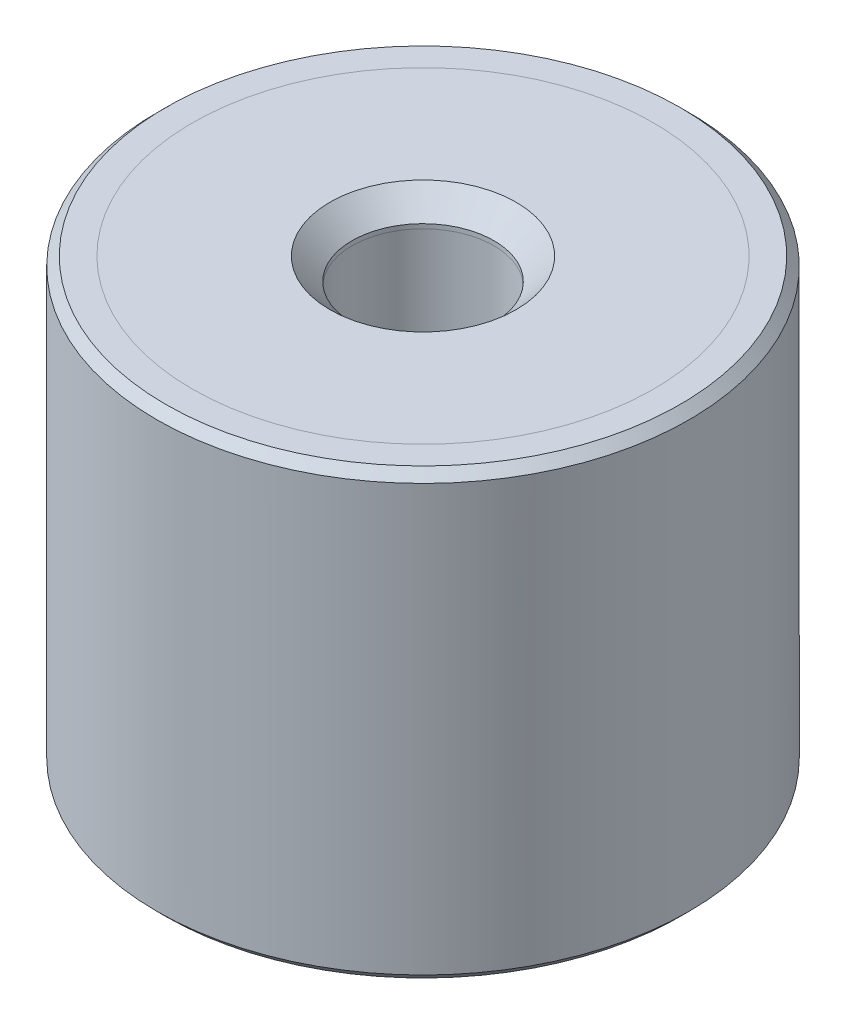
ISO-10303-21;
HEADER;
FILE_DESCRIPTION(('STEP AP214'),'2;1');
FILE_NAME('part.step','',(''),(''),'','','');
FILE_SCHEMA(('AUTOMOTIVE_DESIGN { 1 0 10303 214 1 1 1 1 }'));
ENDSEC;
DATA;
#1=APPLICATION_CONTEXT('core data for automotive mechanical design processes');
#2=APPLICATION_PROTOCOL_DEFINITION('international standard','automotive_design',2000,#1);
#3=PRODUCT_CONTEXT('',#1,'mechanical');
#4=PRODUCT('Part','Part','',(#3));
#5=PRODUCT_RELATED_PRODUCT_CATEGORY('part','',(#4));
#6=PRODUCT_DEFINITION_FORMATION('','',#4);
#7=PRODUCT_DEFINITION_CONTEXT('part definition',#1,'design');
#8=PRODUCT_DEFINITION('design','',#6,#7);
#9=PRODUCT_DEFINITION_SHAPE('','',#8);
#10=(LENGTH_UNIT() NAMED_UNIT(*) SI_UNIT(.MILLI.,.METRE.));
#11=(NAMED_UNIT(*) PLANE_ANGLE_UNIT() SI_UNIT($,.RADIAN.));
#12=(NAMED_UNIT(*) SI_UNIT($,.STERADIAN.) SOLID_ANGLE_UNIT());
#13=UNCERTAINTY_MEASURE_WITH_UNIT(LENGTH_MEASURE(1.E-05),#10,'distance_accuracy_value','');
#14=(GEOMETRIC_REPRESENTATION_CONTEXT(3) GLOBAL_UNCERTAINTY_ASSIGNED_CONTEXT((#13)) GLOBAL_UNIT_ASSIGNED_CONTEXT((#10,
#11,#12)) REPRESENTATION_CONTEXT('',''));
#15=CARTESIAN_POINT('',(0.,0.,0.));
#16=DIRECTION('',(0.,0.,1.));
#17=DIRECTION('',(1.,0.,0.));
#18=AXIS2_PLACEMENT_3D('',#15,#16,#17);
#19=CARTESIAN_POINT('',(0.,46.0340428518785,0.));
#20=DIRECTION('',(0.,1.,0.));
#21=DIRECTION('',(0.,0.,1.));
#22=AXIS2_PLACEMENT_3D('',#19,#20,#21);
#23=CYLINDRICAL_SURFACE('',#22,4.);
#24=CARTESIAN_POINT('',(0.,-22.25,0.));
#25=DIRECTION('',(0.,-1.,0.));
#26=DIRECTION('',(0.,0.,-1.));
#27=AXIS2_PLACEMENT_3D('',#24,#25,#26);
#28=CIRCLE('',#27,4.);
#29=CARTESIAN_POINT('',(0.,-22.25,-4.));
#30=VERTEX_POINT('',#29);
#31=EDGE_CURVE('P0_E10',#30,#30,#28,.T.);
#32=ORIENTED_EDGE('',*,*,#31,.T.);
#33=EDGE_LOOP('',(#32));
#34=FACE_BOUND('',#33,.T.);
#35=CARTESIAN_POINT('',(0.,-22.,0.));
#36=DIRECTION('',(0.,1.,0.));
#37=DIRECTION('',(0.,0.,1.));
#38=AXIS2_PLACEMENT_3D('',#35,#36,#37);
#39=CIRCLE('',#38,4.);
#40=CARTESIAN_POINT('',(0.,-22.,4.));
#41=VERTEX_POINT('',#40);
#42=EDGE_CURVE('P0_E25',#41,#41,#39,.T.);
#43=ORIENTED_EDGE('',*,*,#42,.T.);
#44=EDGE_LOOP('',(#43));
#45=FACE_BOUND('',#44,.T.);
#46=ADVANCED_FACE('P0_F14',(#34,#45),#23,.F.);
#47=CARTESIAN_POINT('',(0.,-22.,4.));
#48=DIRECTION('',(0.,1.,0.));
#49=DIRECTION('',(0.,0.,1.));
#50=AXIS2_PLACEMENT_3D('',#47,#48,#49);
#51=PLANE('',#50);
#52=CARTESIAN_POINT('',(0.,-22.,0.));
#53=DIRECTION('',(0.,1.,0.));
#54=DIRECTION('',(0.,0.,1.));
#55=AXIS2_PLACEMENT_3D('',#52,#53,#54);
#56=CIRCLE('',#55,13.);
#57=CARTESIAN_POINT('',(0.,-22.,13.));
#58=VERTEX_POINT('',#57);
#59=EDGE_CURVE('P0_E29',#58,#58,#56,.T.);
#60=ORIENTED_EDGE('',*,*,#59,.T.);
#61=EDGE_LOOP('',(#60));
#62=FACE_BOUND('',#61,.T.);
#63=ORIENTED_EDGE('',*,*,#42,.F.);
#64=EDGE_LOOP('',(#63));
#65=FACE_BOUND('',#64,.T.);
#66=ADVANCED_FACE('P0_F50',(#62,#65),#51,.T.);
#67=CARTESIAN_POINT('',(0.,46.0340428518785,0.));
#68=DIRECTION('',(0.,1.,0.));
#69=DIRECTION('',(0.,0.,1.));
#70=AXIS2_PLACEMENT_3D('',#67,#68,#69);
#71=CYLINDRICAL_SURFACE('',#70,13.);
#72=CARTESIAN_POINT('',(0.,-23.5,0.));
#73=DIRECTION('',(0.,1.,0.));
#74=DIRECTION('',(0.,0.,1.));
#75=AXIS2_PLACEMENT_3D('',#72,#73,#74);
#76=CIRCLE('',#75,13.);
#77=CARTESIAN_POINT('',(0.,-23.5,13.));
#78=VERTEX_POINT('',#77);
#79=EDGE_CURVE('P0_E34',#78,#78,#76,.T.);
#80=ORIENTED_EDGE('',*,*,#79,.T.);
#81=EDGE_LOOP('',(#80));
#82=FACE_BOUND('',#81,.T.);
#83=ORIENTED_EDGE('',*,*,#59,.F.);
#84=EDGE_LOOP('',(#83));
#85=FACE_BOUND('',#84,.T.);
#86=ADVANCED_FACE('P0_F38',(#82,#85),#71,.T.);
#87=CARTESIAN_POINT('',(0.,-23.5,13.));
#88=DIRECTION('',(0.,-1.,0.));
#89=DIRECTION('',(0.,0.,-1.));
#90=AXIS2_PLACEMENT_3D('',#87,#88,#89);
#91=PLANE('',#90);
#92=CARTESIAN_POINT('',(0.,-23.5,0.));
#93=DIRECTION('',(0.,-1.,0.));
#94=DIRECTION('',(0.,0.,-1.));
#95=AXIS2_PLACEMENT_3D('',#92,#93,#94);
#96=CIRCLE('',#95,5.25);
#97=CARTESIAN_POINT('',(0.,-23.5,-5.25));
#98=VERTEX_POINT('',#97);
#99=EDGE_CURVE('P0_E21',#98,#98,#96,.F.);
#100=ORIENTED_EDGE('',*,*,#99,.T.);
#101=EDGE_LOOP('',(#100));
#102=FACE_BOUND('',#101,.T.);
#103=ORIENTED_EDGE('',*,*,#79,.F.);
#104=EDGE_LOOP('',(#103));
#105=FACE_BOUND('',#104,.T.);
#106=ADVANCED_FACE('P0_F41',(#102,#105),#91,.T.);
#107=CARTESIAN_POINT('',(0.,-23.5,0.));
#108=DIRECTION('',(0.,-1.,0.));
#109=DIRECTION('',(0.,0.,-1.));
#110=AXIS2_PLACEMENT_3D('',#107,#108,#109);
#111=CONICAL_SURFACE('',#110,5.25,0.785398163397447);
#112=ORIENTED_EDGE('',*,*,#31,.F.);
#113=EDGE_LOOP('',(#112));
#114=FACE_BOUND('',#113,.T.);
#115=ORIENTED_EDGE('',*,*,#99,.F.);
#116=EDGE_LOOP('',(#115));
#117=FACE_BOUND('',#116,.T.);
#118=ADVANCED_FACE('P0_F16',(#114,#117),#111,.F.);
#119=CLOSED_SHELL('',(#46,#66,#86,#106,#118));
#120=MANIFOLD_SOLID_BREP('P0_B1',#119);
#121=CARTESIAN_POINT('',(0.,69.5340428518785,0.));
#122=DIRECTION('',(0.,1.,0.));
#123=DIRECTION('',(0.,0.,1.));
#124=AXIS2_PLACEMENT_3D('',#121,#122,#123);
#125=CYLINDRICAL_SURFACE('',#124,4.);
#126=CARTESIAN_POINT('',(0.,0.249999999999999,0.));
#127=DIRECTION('',(0.,1.,0.));
#128=DIRECTION('',(0.,0.,1.));
#129=AXIS2_PLACEMENT_3D('',#126,#127,#128);
#130=CIRCLE('',#129,4.);
#131=CARTESIAN_POINT('',(0.,0.249999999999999,4.));
#132=VERTEX_POINT('',#131);
#133=EDGE_CURVE('P1_E21',#132,#132,#130,.T.);
#134=ORIENTED_EDGE('',*,*,#133,.T.);
#135=EDGE_LOOP('',(#134));
#136=FACE_BOUND('',#135,.T.);
#137=CARTESIAN_POINT('',(0.,0.,0.));
#138=DIRECTION('',(0.,1.,0.));
#139=DIRECTION('',(0.,0.,1.));
#140=AXIS2_PLACEMENT_3D('',#137,#138,#139);
#141=CIRCLE('',#140,4.);
#142=CARTESIAN_POINT('',(0.,0.,4.));
#143=VERTEX_POINT('',#142);
#144=EDGE_CURVE('P1_E34',#143,#143,#141,.T.);
#145=ORIENTED_EDGE('',*,*,#144,.F.);
#146=EDGE_LOOP('',(#145));
#147=FACE_BOUND('',#146,.T.);
#148=ADVANCED_FACE('P1_F14',(#136,#147),#125,.F.);
#149=CARTESIAN_POINT('',(0.,1.5,4.));
#150=DIRECTION('',(0.,1.,0.));
#151=DIRECTION('',(0.,0.,1.));
#152=AXIS2_PLACEMENT_3D('',#149,#150,#151);
#153=PLANE('',#152);
#154=CARTESIAN_POINT('',(0.,1.5,0.));
#155=DIRECTION('',(0.,1.,0.));
#156=DIRECTION('',(0.,0.,1.));
#157=AXIS2_PLACEMENT_3D('',#154,#155,#156);
#158=CIRCLE('',#157,5.25);
#159=CARTESIAN_POINT('',(0.,1.5,5.25));
#160=VERTEX_POINT('',#159);
#161=EDGE_CURVE('P1_E10',#160,#160,#158,.F.);
#162=ORIENTED_EDGE('',*,*,#161,.T.);
#163=EDGE_LOOP('',(#162));
#164=FACE_BOUND('',#163,.T.);
#165=CARTESIAN_POINT('',(0.,1.5,0.));
#166=DIRECTION('',(0.,1.,0.));
#167=DIRECTION('',(0.,0.,1.));
#168=AXIS2_PLACEMENT_3D('',#165,#166,#167);
#169=CIRCLE('',#168,13.);
#170=CARTESIAN_POINT('',(0.,1.5,13.));
#171=VERTEX_POINT('',#170);
#172=EDGE_CURVE('P1_E25',#171,#171,#169,.T.);
#173=ORIENTED_EDGE('',*,*,#172,.T.);
#174=EDGE_LOOP('',(#173));
#175=FACE_BOUND('',#174,.T.);
#176=ADVANCED_FACE('P1_F42',(#164,#175),#153,.T.);
#177=CARTESIAN_POINT('',(0.,69.5340428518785,0.));
#178=DIRECTION('',(0.,1.,0.));
#179=DIRECTION('',(0.,0.,1.));
#180=AXIS2_PLACEMENT_3D('',#177,#178,#179);
#181=CYLINDRICAL_SURFACE('',#180,13.);
#182=CARTESIAN_POINT('',(0.,0.,0.));
#183=DIRECTION('',(0.,1.,0.));
#184=DIRECTION('',(0.,0.,1.));
#185=AXIS2_PLACEMENT_3D('',#182,#183,#184);
#186=CIRCLE('',#185,13.);
#187=CARTESIAN_POINT('',(0.,0.,13.));
#188=VERTEX_POINT('',#187);
#189=EDGE_CURVE('P1_E29',#188,#188,#186,.T.);
#190=ORIENTED_EDGE('',*,*,#189,.T.);
#191=EDGE_LOOP('',(#190));
#192=FACE_BOUND('',#191,.T.);
#193=ORIENTED_EDGE('',*,*,#172,.F.);
#194=EDGE_LOOP('',(#193));
#195=FACE_BOUND('',#194,.T.);
#196=ADVANCED_FACE('P1_F47',(#192,#195),#181,.T.);
#197=CARTESIAN_POINT('',(0.,0.,13.));
#198=DIRECTION('',(0.,-1.,0.));
#199=DIRECTION('',(0.,0.,-1.));
#200=AXIS2_PLACEMENT_3D('',#197,#198,#199);
#201=PLANE('',#200);
#202=ORIENTED_EDGE('',*,*,#144,.T.);
#203=EDGE_LOOP('',(#202));
#204=FACE_BOUND('',#203,.T.);
#205=ORIENTED_EDGE('',*,*,#189,.F.);
#206=EDGE_LOOP('',(#205));
#207=FACE_BOUND('',#206,.T.);
#208=ADVANCED_FACE('P1_F38',(#204,#207),#201,.T.);
#209=CARTESIAN_POINT('',(0.,0.249999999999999,0.));
#210=DIRECTION('',(0.,1.,0.));
#211=DIRECTION('',(0.,0.,1.));
#212=AXIS2_PLACEMENT_3D('',#209,#210,#211);
#213=CONICAL_SURFACE('',#212,4.,0.785398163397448);
#214=ORIENTED_EDGE('',*,*,#161,.F.);
#215=EDGE_LOOP('',(#214));
#216=FACE_BOUND('',#215,.T.);
#217=ORIENTED_EDGE('',*,*,#133,.F.);
#218=EDGE_LOOP('',(#217));
#219=FACE_BOUND('',#218,.T.);
#220=ADVANCED_FACE('P1_F16',(#216,#219),#213,.F.);
#221=CLOSED_SHELL('',(#148,#176,#196,#208,#220));
#222=MANIFOLD_SOLID_BREP('P1_B1',#221);
#223=CARTESIAN_POINT('',(0.,0.,0.));
#224=DIRECTION('',(0.,1.,0.));
#225=DIRECTION('',(0.,0.,1.));
#226=AXIS2_PLACEMENT_3D('',#223,#224,#225);
#227=PLANE('',#226);
#228=CARTESIAN_POINT('',(0.,0.,0.));
#229=DIRECTION('',(0.,1.,0.));
#230=DIRECTION('',(0.,0.,1.));
#231=AXIS2_PLACEMENT_3D('',#228,#229,#230);
#232=CIRCLE('',#231,4.);
#233=CARTESIAN_POINT('',(0.,0.,4.));
#234=VERTEX_POINT('',#233);
#235=EDGE_CURVE('P2_E46',#234,#234,#232,.T.);
#236=ORIENTED_EDGE('',*,*,#235,.F.);
#237=EDGE_LOOP('',(#236));
#238=FACE_BOUND('',#237,.T.);
#239=CARTESIAN_POINT('',(0.,0.,0.));
#240=DIRECTION('',(0.,1.,0.));
#241=DIRECTION('',(0.,0.,1.));
#242=AXIS2_PLACEMENT_3D('',#239,#240,#241);
#243=CIRCLE('',#242,13.);
#244=CARTESIAN_POINT('',(0.,0.,13.));
#245=VERTEX_POINT('',#244);
#246=EDGE_CURVE('P2_E33',#245,#245,#243,.T.);
#247=ORIENTED_EDGE('',*,*,#246,.T.);
#248=EDGE_LOOP('',(#247));
#249=FACE_BOUND('',#248,.T.);
#250=ADVANCED_FACE('P2_F13',(#238,#249),#227,.T.);
#251=CARTESIAN_POINT('',(0.,65.5134936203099,0.));
#252=DIRECTION('',(0.,1.,0.));
#253=DIRECTION('',(0.,0.,1.));
#254=AXIS2_PLACEMENT_3D('',#251,#252,#253);
#255=CYLINDRICAL_SURFACE('',#254,13.);
#256=CARTESIAN_POINT('',(0.,1.5,0.));
#257=DIRECTION('',(0.,1.,0.));
#258=DIRECTION('',(0.,0.,1.));
#259=AXIS2_PLACEMENT_3D('',#256,#257,#258);
#260=CIRCLE('',#259,13.);
#261=CARTESIAN_POINT('',(0.,1.5,13.));
#262=VERTEX_POINT('',#261);
#263=EDGE_CURVE('P2_E36',#262,#262,#260,.T.);
#264=ORIENTED_EDGE('',*,*,#263,.T.);
#265=EDGE_LOOP('',(#264));
#266=FACE_BOUND('',#265,.T.);
#267=ORIENTED_EDGE('',*,*,#246,.F.);
#268=EDGE_LOOP('',(#267));
#269=FACE_BOUND('',#268,.T.);
#270=ADVANCED_FACE('P2_F92',(#266,#269),#255,.F.);
#271=CARTESIAN_POINT('',(0.,1.5,13.));
#272=DIRECTION('',(0.,1.,0.));
#273=DIRECTION('',(0.,0.,1.));
#274=AXIS2_PLACEMENT_3D('',#271,#272,#273);
#275=PLANE('',#274);
#276=CARTESIAN_POINT('',(0.,1.5,0.));
#277=DIRECTION('',(0.,1.,0.));
#278=DIRECTION('',(0.,0.,1.));
#279=AXIS2_PLACEMENT_3D('',#276,#277,#278);
#280=CIRCLE('',#279,14.5);
#281=CARTESIAN_POINT('',(0.,1.5,14.5));
#282=VERTEX_POINT('',#281);
#283=EDGE_CURVE('P2_E9',#282,#282,#280,.T.);
#284=ORIENTED_EDGE('',*,*,#283,.T.);
#285=EDGE_LOOP('',(#284));
#286=FACE_BOUND('',#285,.T.);
#287=ORIENTED_EDGE('',*,*,#263,.F.);
#288=EDGE_LOOP('',(#287));
#289=FACE_BOUND('',#288,.T.);
#290=ADVANCED_FACE('P2_F88',(#286,#289),#275,.T.);
#291=CARTESIAN_POINT('',(0.,65.5134936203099,0.));
#292=DIRECTION('',(0.,1.,0.));
#293=DIRECTION('',(0.,0.,1.));
#294=AXIS2_PLACEMENT_3D('',#291,#292,#293);
#295=CYLINDRICAL_SURFACE('',#294,15.);
#296=CARTESIAN_POINT('',(0.,-23.,0.));
#297=DIRECTION('',(0.,-1.,0.));
#298=DIRECTION('',(0.,0.,-1.));
#299=AXIS2_PLACEMENT_3D('',#296,#297,#298);
#300=CIRCLE('',#299,15.);
#301=CARTESIAN_POINT('',(0.,-23.,-15.));
#302=VERTEX_POINT('',#301);
#303=EDGE_CURVE('P2_E24',#302,#302,#300,.F.);
#304=ORIENTED_EDGE('',*,*,#303,.T.);
#305=EDGE_LOOP('',(#304));
#306=FACE_BOUND('',#305,.T.);
#307=CARTESIAN_POINT('',(0.,1.,0.));
#308=DIRECTION('',(0.,1.,0.));
#309=DIRECTION('',(0.,0.,1.));
#310=AXIS2_PLACEMENT_3D('',#307,#308,#309);
#311=CIRCLE('',#310,15.);
#312=CARTESIAN_POINT('',(0.,1.,15.));
#313=VERTEX_POINT('',#312);
#314=EDGE_CURVE('P2_E28',#313,#313,#311,.F.);
#315=ORIENTED_EDGE('',*,*,#314,.T.);
#316=EDGE_LOOP('',(#315));
#317=FACE_BOUND('',#316,.T.);
#318=ADVANCED_FACE('P2_F82',(#306,#317),#295,.T.);
#319=CARTESIAN_POINT('',(0.,-23.5,15.));
#320=DIRECTION('',(0.,-1.,0.));
#321=DIRECTION('',(0.,0.,-1.));
#322=AXIS2_PLACEMENT_3D('',#319,#320,#321);
#323=PLANE('',#322);
#324=CARTESIAN_POINT('',(0.,-23.5,0.));
#325=DIRECTION('',(0.,-1.,0.));
#326=DIRECTION('',(0.,0.,-1.));
#327=AXIS2_PLACEMENT_3D('',#324,#325,#326);
#328=CIRCLE('',#327,14.5);
#329=CARTESIAN_POINT('',(0.,-23.5,-14.5));
#330=VERTEX_POINT('',#329);
#331=EDGE_CURVE('P2_E20',#330,#330,#328,.T.);
#332=ORIENTED_EDGE('',*,*,#331,.T.);
#333=EDGE_LOOP('',(#332));
#334=FACE_BOUND('',#333,.T.);
#335=CARTESIAN_POINT('',(0.,-23.5,0.));
#336=DIRECTION('',(0.,1.,0.));
#337=DIRECTION('',(0.,0.,1.));
#338=AXIS2_PLACEMENT_3D('',#335,#336,#337);
#339=CIRCLE('',#338,13.);
#340=CARTESIAN_POINT('',(0.,-23.5,13.));
#341=VERTEX_POINT('',#340);
#342=EDGE_CURVE('P2_E39',#341,#341,#339,.T.);
#343=ORIENTED_EDGE('',*,*,#342,.T.);
#344=EDGE_LOOP('',(#343));
#345=FACE_BOUND('',#344,.T.);
#346=ADVANCED_FACE('P2_F77',(#334,#345),#323,.T.);
#347=CARTESIAN_POINT('',(0.,65.5134936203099,0.));
#348=DIRECTION('',(0.,1.,0.));
#349=DIRECTION('',(0.,0.,1.));
#350=AXIS2_PLACEMENT_3D('',#347,#348,#349);
#351=CYLINDRICAL_SURFACE('',#350,13.);
#352=CARTESIAN_POINT('',(0.,-22.,0.));
#353=DIRECTION('',(0.,1.,0.));
#354=DIRECTION('',(0.,0.,1.));
#355=AXIS2_PLACEMENT_3D('',#352,#353,#354);
#356=CIRCLE('',#355,13.);
#357=CARTESIAN_POINT('',(0.,-22.,13.));
#358=VERTEX_POINT('',#357);
#359=EDGE_CURVE('P2_E42',#358,#358,#356,.T.);
#360=ORIENTED_EDGE('',*,*,#359,.T.);
#361=EDGE_LOOP('',(#360));
#362=FACE_BOUND('',#361,.T.);
#363=ORIENTED_EDGE('',*,*,#342,.F.);
#364=EDGE_LOOP('',(#363));
#365=FACE_BOUND('',#364,.T.);
#366=ADVANCED_FACE('P2_F71',(#362,#365),#351,.F.);
#367=CARTESIAN_POINT('',(0.,-22.,13.));
#368=DIRECTION('',(0.,-1.,0.));
#369=DIRECTION('',(0.,0.,-1.));
#370=AXIS2_PLACEMENT_3D('',#367,#368,#369);
#371=PLANE('',#370);
#372=CARTESIAN_POINT('',(0.,-22.,0.));
#373=DIRECTION('',(0.,-1.,0.));
#374=DIRECTION('',(0.,0.,-1.));
#375=AXIS2_PLACEMENT_3D('',#372,#373,#374);
#376=CIRCLE('',#375,4.);
#377=CARTESIAN_POINT('',(0.,-22.,-4.));
#378=VERTEX_POINT('',#377);
#379=EDGE_CURVE('P2_E52',#378,#378,#376,.T.);
#380=ORIENTED_EDGE('',*,*,#379,.F.);
#381=EDGE_LOOP('',(#380));
#382=FACE_BOUND('',#381,.T.);
#383=ORIENTED_EDGE('',*,*,#359,.F.);
#384=EDGE_LOOP('',(#383));
#385=FACE_BOUND('',#384,.T.);
#386=ADVANCED_FACE('P2_F67',(#382,#385),#371,.T.);
#387=CARTESIAN_POINT('',(0.,-23.,0.));
#388=DIRECTION('',(0.,1.,0.));
#389=DIRECTION('',(0.,0.,1.));
#390=AXIS2_PLACEMENT_3D('',#387,#388,#389);
#391=CONICAL_SURFACE('',#390,15.,0.785398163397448);
#392=ORIENTED_EDGE('',*,*,#331,.F.);
#393=EDGE_LOOP('',(#392));
#394=FACE_BOUND('',#393,.T.);
#395=ORIENTED_EDGE('',*,*,#303,.F.);
#396=EDGE_LOOP('',(#395));
#397=FACE_BOUND('',#396,.T.);
#398=ADVANCED_FACE('P2_F70',(#394,#397),#391,.T.);
#399=CARTESIAN_POINT('',(0.,1.5,0.));
#400=DIRECTION('',(0.,-1.,0.));
#401=DIRECTION('',(0.,0.,-1.));
#402=AXIS2_PLACEMENT_3D('',#399,#400,#401);
#403=CONICAL_SURFACE('',#402,14.5,0.785398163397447);
#404=ORIENTED_EDGE('',*,*,#314,.F.);
#405=EDGE_LOOP('',(#404));
#406=FACE_BOUND('',#405,.T.);
#407=ORIENTED_EDGE('',*,*,#283,.F.);
#408=EDGE_LOOP('',(#407));
#409=FACE_BOUND('',#408,.T.);
#410=ADVANCED_FACE('P2_F15',(#406,#409),#403,.T.);
#411=CARTESIAN_POINT('',(0.,-6.5,0.));
#412=DIRECTION('',(0.,1.,0.));
#413=DIRECTION('',(0.,0.,1.));
#414=AXIS2_PLACEMENT_3D('',#411,#412,#413);
#415=CYLINDRICAL_SURFACE('',#414,4.);
#416=CARTESIAN_POINT('',(0.,-6.5,0.));
#417=DIRECTION('',(0.,1.,0.));
#418=DIRECTION('',(0.,0.,1.));
#419=AXIS2_PLACEMENT_3D('',#416,#417,#418);
#420=CIRCLE('',#419,4.);
#421=CARTESIAN_POINT('',(0.,-6.5,4.));
#422=VERTEX_POINT('',#421);
#423=EDGE_CURVE('P2_E45',#422,#422,#420,.T.);
#424=CARTESIAN_POINT('',(0.,-6.5,4.));
#425=CARTESIAN_POINT('',(0.,-6.43229166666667,4.));
#426=CARTESIAN_POINT('',(0.,-6.36458333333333,4.));
#427=CARTESIAN_POINT('',(0.,-6.22916666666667,4.));
#428=CARTESIAN_POINT('',(0.,-6.16145833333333,4.));
#429=CARTESIAN_POINT('',(0.,-6.02604166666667,4.));
#430=CARTESIAN_POINT('',(0.,-5.95833333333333,4.));
#431=CARTESIAN_POINT('',(0.,-5.82291666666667,4.));
#432=CARTESIAN_POINT('',(0.,-5.75520833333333,4.));
#433=CARTESIAN_POINT('',(0.,-5.61979166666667,4.));
#434=CARTESIAN_POINT('',(0.,-5.55208333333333,4.));
#435=CARTESIAN_POINT('',(0.,-5.41666666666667,4.));
#436=CARTESIAN_POINT('',(0.,-5.34895833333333,4.));
#437=CARTESIAN_POINT('',(0.,-5.21354166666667,4.));
#438=CARTESIAN_POINT('',(0.,-5.14583333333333,4.));
#439=CARTESIAN_POINT('',(0.,-5.01041666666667,4.));
#440=CARTESIAN_POINT('',(0.,-4.94270833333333,4.));
#441=CARTESIAN_POINT('',(0.,-4.80729166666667,4.));
#442=CARTESIAN_POINT('',(0.,-4.73958333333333,4.));
#443=CARTESIAN_POINT('',(0.,-4.60416666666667,4.));
#444=CARTESIAN_POINT('',(0.,-4.53645833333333,4.));
#445=CARTESIAN_POINT('',(0.,-4.40104166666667,4.));
#446=CARTESIAN_POINT('',(0.,-4.33333333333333,4.));
#447=CARTESIAN_POINT('',(0.,-4.19791666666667,4.));
#448=CARTESIAN_POINT('',(0.,-4.13020833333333,4.));
#449=CARTESIAN_POINT('',(0.,-3.99479166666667,4.));
#450=CARTESIAN_POINT('',(0.,-3.92708333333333,4.));
#451=CARTESIAN_POINT('',(0.,-3.79166666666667,4.));
#452=CARTESIAN_POINT('',(0.,-3.72395833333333,4.));
#453=CARTESIAN_POINT('',(0.,-3.58854166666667,4.));
#454=CARTESIAN_POINT('',(0.,-3.52083333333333,4.));
#455=CARTESIAN_POINT('',(0.,-3.38541666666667,4.));
#456=CARTESIAN_POINT('',(0.,-3.31770833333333,4.));
#457=CARTESIAN_POINT('',(0.,-3.18229166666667,4.));
#458=CARTESIAN_POINT('',(0.,-3.11458333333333,4.));
#459=CARTESIAN_POINT('',(0.,-2.97916666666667,4.));
#460=CARTESIAN_POINT('',(0.,-2.91145833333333,4.));
#461=CARTESIAN_POINT('',(0.,-2.77604166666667,4.));
#462=CARTESIAN_POINT('',(0.,-2.70833333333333,4.));
#463=CARTESIAN_POINT('',(0.,-2.57291666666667,4.));
#464=CARTESIAN_POINT('',(0.,-2.50520833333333,4.));
#465=CARTESIAN_POINT('',(0.,-2.36979166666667,4.));
#466=CARTESIAN_POINT('',(0.,-2.30208333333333,4.));
#467=CARTESIAN_POINT('',(0.,-2.16666666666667,4.));
#468=CARTESIAN_POINT('',(0.,-2.09895833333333,4.));
#469=CARTESIAN_POINT('',(0.,-1.96354166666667,4.));
#470=CARTESIAN_POINT('',(0.,-1.89583333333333,4.));
#471=CARTESIAN_POINT('',(0.,-1.76041666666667,4.));
#472=CARTESIAN_POINT('',(0.,-1.69270833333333,4.));
#473=CARTESIAN_POINT('',(0.,-1.55729166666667,4.));
#474=CARTESIAN_POINT('',(0.,-1.48958333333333,4.));
#475=CARTESIAN_POINT('',(0.,-1.35416666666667,4.));
#476=CARTESIAN_POINT('',(0.,-1.28645833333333,4.));
#477=CARTESIAN_POINT('',(0.,-1.15104166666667,4.));
#478=CARTESIAN_POINT('',(0.,-1.08333333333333,4.));
#479=CARTESIAN_POINT('',(0.,-0.947916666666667,4.));
#480=CARTESIAN_POINT('',(0.,-0.880208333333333,4.));
#481=CARTESIAN_POINT('',(0.,-0.744791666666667,4.));
#482=CARTESIAN_POINT('',(0.,-0.677083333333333,4.));
#483=CARTESIAN_POINT('',(0.,-0.541666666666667,4.));
#484=CARTESIAN_POINT('',(0.,-0.473958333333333,4.));
#485=CARTESIAN_POINT('',(0.,-0.338541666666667,4.));
#486=CARTESIAN_POINT('',(0.,-0.270833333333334,4.));
#487=CARTESIAN_POINT('',(0.,-0.135416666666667,4.));
#488=CARTESIAN_POINT('',(0.,-0.0677083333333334,4.));
#489=CARTESIAN_POINT('',(0.,0.,4.));
#490=B_SPLINE_CURVE_WITH_KNOTS('',3,(#424,#425,#426,#427,#428,#429,#430,#431,#432,#433,#434,
#435,#436,#437,#438,#439,#440,#441,#442,#443,#444,#445,#446,#447,#448,#449,#450,#451,#452,#453,
#454,#455,#456,#457,#458,#459,#460,#461,#462,#463,#464,#465,#466,#467,#468,#469,#470,#471,#472,
#473,#474,#475,#476,#477,#478,#479,#480,#481,#482,#483,#484,#485,#486,#487,#488,#489),
.UNSPECIFIED.,.F.,.F.,(4,2,2,2,2,2,2,2,2,2,2,2,2,2,2,2,2,2,2,2,2,2,2,2,2,2,2,2,2,2,2,2,4),(0.,
0.203124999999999,0.40625,0.609375,0.8125,1.015625,1.21875,1.421875,1.625,1.828125,2.03125,
2.234375,2.4375,2.640625,2.84375,3.046875,3.25,3.453125,3.65625,3.859375,4.0625,4.265625,
4.46875,4.671875,4.875,5.078125,5.28125,5.484375,5.6875,5.890625,6.09375,6.296875,6.5),.UNSPECIFIED.);
#491=EDGE_CURVE('P2_BSEAM108',#422,#234,#490,.T.);
#492=ORIENTED_EDGE('',*,*,#423,.F.);
#493=ORIENTED_EDGE('',*,*,#235,.T.);
#494=ORIENTED_EDGE('',*,*,#491,.T.);
#495=ORIENTED_EDGE('',*,*,#491,.F.);
#496=EDGE_LOOP('',(#492,#494,#493,#495));
#497=FACE_BOUND('',#496,.T.);
#498=ADVANCED_FACE('P2_F108',(#497),#415,.F.);
#499=CARTESIAN_POINT('',(0.,-6.5,0.));
#500=DIRECTION('',(0.,1.,0.));
#501=DIRECTION('',(0.,0.,1.));
#502=AXIS2_PLACEMENT_3D('',#499,#500,#501);
#503=PLANE('',#502);
#504=ORIENTED_EDGE('',*,*,#423,.T.);
#505=EDGE_LOOP('',(#504));
#506=FACE_BOUND('',#505,.T.);
#507=ADVANCED_FACE('P2_F63',(#506),#503,.T.);
#508=CARTESIAN_POINT('',(0.,-15.5,0.));
#509=DIRECTION('',(0.,-1.,0.));
#510=DIRECTION('',(0.,0.,-1.));
#511=AXIS2_PLACEMENT_3D('',#508,#509,#510);
#512=CYLINDRICAL_SURFACE('',#511,4.);
#513=CARTESIAN_POINT('',(0.,-15.5,0.));
#514=DIRECTION('',(0.,-1.,0.));
#515=DIRECTION('',(0.,0.,-1.));
#516=AXIS2_PLACEMENT_3D('',#513,#514,#515);
#517=CIRCLE('',#516,4.);
#518=CARTESIAN_POINT('',(0.,-15.5,-4.));
#519=VERTEX_POINT('',#518);
#520=EDGE_CURVE('P2_E49',#519,#519,#517,.T.);
#521=CARTESIAN_POINT('',(0.,-15.5,-4.));
#522=CARTESIAN_POINT('',(0.,-15.5677083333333,-4.));
#523=CARTESIAN_POINT('',(0.,-15.6354166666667,-4.));
#524=CARTESIAN_POINT('',(0.,-15.7708333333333,-4.));
#525=CARTESIAN_POINT('',(0.,-15.8385416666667,-4.));
#526=CARTESIAN_POINT('',(0.,-15.9739583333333,-4.));
#527=CARTESIAN_POINT('',(0.,-16.0416666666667,-4.));
#528=CARTESIAN_POINT('',(0.,-16.1770833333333,-4.));
#529=CARTESIAN_POINT('',(0.,-16.2447916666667,-4.));
#530=CARTESIAN_POINT('',(0.,-16.3802083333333,-4.));
#531=CARTESIAN_POINT('',(0.,-16.4479166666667,-4.));
#532=CARTESIAN_POINT('',(0.,-16.5833333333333,-4.));
#533=CARTESIAN_POINT('',(0.,-16.6510416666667,-4.));
#534=CARTESIAN_POINT('',(0.,-16.7864583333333,-4.));
#535=CARTESIAN_POINT('',(0.,-16.8541666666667,-4.));
#536=CARTESIAN_POINT('',(0.,-16.9895833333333,-4.));
#537=CARTESIAN_POINT('',(0.,-17.0572916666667,-4.));
#538=CARTESIAN_POINT('',(0.,-17.1927083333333,-4.));
#539=CARTESIAN_POINT('',(0.,-17.2604166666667,-4.));
#540=CARTESIAN_POINT('',(0.,-17.3958333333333,-4.));
#541=CARTESIAN_POINT('',(0.,-17.4635416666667,-4.));
#542=CARTESIAN_POINT('',(0.,-17.5989583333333,-4.));
#543=CARTESIAN_POINT('',(0.,-17.6666666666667,-4.));
#544=CARTESIAN_POINT('',(0.,-17.8020833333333,-4.));
#545=CARTESIAN_POINT('',(0.,-17.8697916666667,-4.));
#546=CARTESIAN_POINT('',(0.,-18.0052083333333,-4.));
#547=CARTESIAN_POINT('',(0.,-18.0729166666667,-4.));
#548=CARTESIAN_POINT('',(0.,-18.2083333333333,-4.));
#549=CARTESIAN_POINT('',(0.,-18.2760416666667,-4.));
#550=CARTESIAN_POINT('',(0.,-18.4114583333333,-4.));
#551=CARTESIAN_POINT('',(0.,-18.4791666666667,-4.));
#552=CARTESIAN_POINT('',(0.,-18.6145833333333,-4.));
#553=CARTESIAN_POINT('',(0.,-18.6822916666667,-4.));
#554=CARTESIAN_POINT('',(0.,-18.8177083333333,-4.));
#555=CARTESIAN_POINT('',(0.,-18.8854166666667,-4.));
#556=CARTESIAN_POINT('',(0.,-19.0208333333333,-4.));
#557=CARTESIAN_POINT('',(0.,-19.0885416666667,-4.));
#558=CARTESIAN_POINT('',(0.,-19.2239583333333,-4.));
#559=CARTESIAN_POINT('',(0.,-19.2916666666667,-4.));
#560=CARTESIAN_POINT('',(0.,-19.4270833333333,-4.));
#561=CARTESIAN_POINT('',(0.,-19.4947916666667,-4.));
#562=CARTESIAN_POINT('',(0.,-19.6302083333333,-4.));
#563=CARTESIAN_POINT('',(0.,-19.6979166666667,-4.));
#564=CARTESIAN_POINT('',(0.,-19.8333333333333,-4.));
#565=CARTESIAN_POINT('',(0.,-19.9010416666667,-4.));
#566=CARTESIAN_POINT('',(0.,-20.0364583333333,-4.));
#567=CARTESIAN_POINT('',(0.,-20.1041666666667,-4.));
#568=CARTESIAN_POINT('',(0.,-20.2395833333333,-4.));
#569=CARTESIAN_POINT('',(0.,-20.3072916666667,-4.));
#570=CARTESIAN_POINT('',(0.,-20.4427083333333,-4.));
#571=CARTESIAN_POINT('',(0.,-20.5104166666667,-4.));
#572=CARTESIAN_POINT('',(0.,-20.6458333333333,-4.));
#573=CARTESIAN_POINT('',(0.,-20.7135416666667,-4.));
#574=CARTESIAN_POINT('',(0.,-20.8489583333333,-4.));
#575=CARTESIAN_POINT('',(0.,-20.9166666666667,-4.));
#576=CARTESIAN_POINT('',(0.,-21.0520833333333,-4.));
#577=CARTESIAN_POINT('',(0.,-21.1197916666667,-4.));
#578=CARTESIAN_POINT('',(0.,-21.2552083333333,-4.));
#579=CARTESIAN_POINT('',(0.,-21.3229166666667,-4.));
#580=CARTESIAN_POINT('',(0.,-21.4583333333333,-4.));
#581=CARTESIAN_POINT('',(0.,-21.5260416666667,-4.));
#582=CARTESIAN_POINT('',(0.,-21.6614583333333,-4.));
#583=CARTESIAN_POINT('',(0.,-21.7291666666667,-4.));
#584=CARTESIAN_POINT('',(0.,-21.8645833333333,-4.));
#585=CARTESIAN_POINT('',(0.,-21.9322916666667,-4.));
#586=CARTESIAN_POINT('',(0.,-22.,-4.));
#587=B_SPLINE_CURVE_WITH_KNOTS('',3,(#521,#522,#523,#524,#525,#526,#527,#528,#529,#530,#531,
#532,#533,#534,#535,#536,#537,#538,#539,#540,#541,#542,#543,#544,#545,#546,#547,#548,#549,#550,
#551,#552,#553,#554,#555,#556,#557,#558,#559,#560,#561,#562,#563,#564,#565,#566,#567,#568,#569,
#570,#571,#572,#573,#574,#575,#576,#577,#578,#579,#580,#581,#582,#583,#584,#585,#586),
.UNSPECIFIED.,.F.,.F.,(4,2,2,2,2,2,2,2,2,2,2,2,2,2,2,2,2,2,2,2,2,2,2,2,2,2,2,2,2,2,2,2,4),(0.,
0.203124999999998,0.40625,0.609374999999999,0.812499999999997,1.015625,1.21875,1.421875,1.625,
1.828125,2.03125,2.234375,2.4375,2.640625,2.84375,3.046875,3.25,3.453125,3.65625,3.859375,
4.0625,4.26562499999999,4.46875,4.671875,4.875,5.078125,5.28125,5.484375,5.6875,5.890625,
6.09374999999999,6.296875,6.5),.UNSPECIFIED.);
#588=EDGE_CURVE('P2_BSEAM60',#519,#378,#587,.T.);
#589=ORIENTED_EDGE('',*,*,#520,.F.);
#590=ORIENTED_EDGE('',*,*,#379,.T.);
#591=ORIENTED_EDGE('',*,*,#588,.T.);
#592=ORIENTED_EDGE('',*,*,#588,.F.);
#593=EDGE_LOOP('',(#589,#591,#590,#592));
#594=FACE_BOUND('',#593,.T.);
#595=ADVANCED_FACE('P2_F60',(#594),#512,.F.);
#596=CARTESIAN_POINT('',(0.,-15.5,0.));
#597=DIRECTION('',(0.,-1.,0.));
#598=DIRECTION('',(0.,0.,-1.));
#599=AXIS2_PLACEMENT_3D('',#596,#597,#598);
#600=PLANE('',#599);
#601=ORIENTED_EDGE('',*,*,#520,.T.);
#602=EDGE_LOOP('',(#601));
#603=FACE_BOUND('',#602,.T.);
#604=ADVANCED_FACE('P2_F58',(#603),#600,.T.);
#605=CLOSED_SHELL('',(#250,#270,#290,#318,#346,#366,#386,#398,#410,#498,#507,#595,#604));
#606=MANIFOLD_SOLID_BREP('P2_B1',#605);
#607=ADVANCED_BREP_SHAPE_REPRESENTATION('',(#18,#120,#222,#606),#14);
#608=SHAPE_DEFINITION_REPRESENTATION(#9,#607);
ENDSEC;
END-ISO-10303-21;
